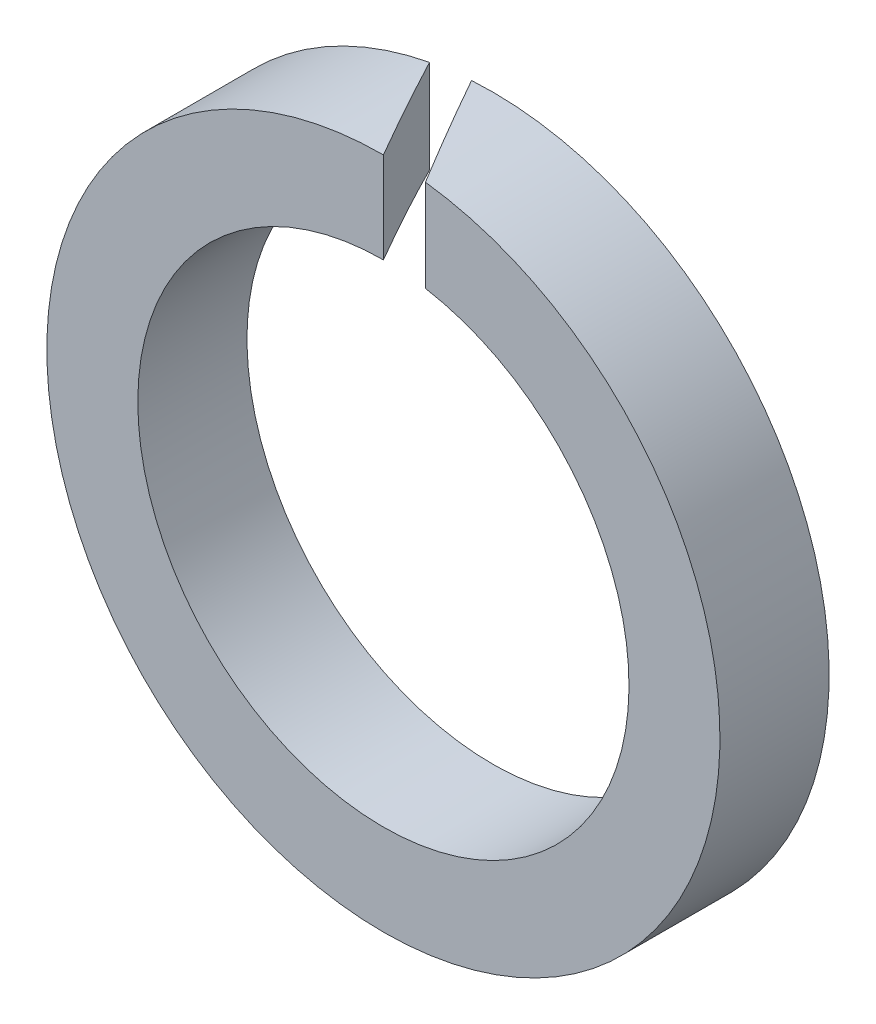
ISO-10303-21;
HEADER;
FILE_DESCRIPTION(('STEP AP214'),'2;1');
FILE_NAME('part.step','',(''),(''),'','','');
FILE_SCHEMA(('AUTOMOTIVE_DESIGN { 1 0 10303 214 1 1 1 1 }'));
ENDSEC;
DATA;
#1=APPLICATION_CONTEXT('core data for automotive mechanical design processes');
#2=APPLICATION_PROTOCOL_DEFINITION('international standard','automotive_design',2000,#1);
#3=PRODUCT_CONTEXT('',#1,'mechanical');
#4=PRODUCT('Part','Part','',(#3));
#5=PRODUCT_RELATED_PRODUCT_CATEGORY('part','',(#4));
#6=PRODUCT_DEFINITION_FORMATION('','',#4);
#7=PRODUCT_DEFINITION_CONTEXT('part definition',#1,'design');
#8=PRODUCT_DEFINITION('design','',#6,#7);
#9=PRODUCT_DEFINITION_SHAPE('','',#8);
#10=(LENGTH_UNIT() NAMED_UNIT(*) SI_UNIT(.MILLI.,.METRE.));
#11=(NAMED_UNIT(*) PLANE_ANGLE_UNIT() SI_UNIT($,.RADIAN.));
#12=(NAMED_UNIT(*) SI_UNIT($,.STERADIAN.) SOLID_ANGLE_UNIT());
#13=UNCERTAINTY_MEASURE_WITH_UNIT(LENGTH_MEASURE(1.E-05),#10,'distance_accuracy_value','');
#14=(GEOMETRIC_REPRESENTATION_CONTEXT(3) GLOBAL_UNCERTAINTY_ASSIGNED_CONTEXT((#13)) GLOBAL_UNIT_ASSIGNED_CONTEXT((#10,
#11,#12)) REPRESENTATION_CONTEXT('',''));
#15=CARTESIAN_POINT('',(0.,0.,0.));
#16=DIRECTION('',(0.,0.,1.));
#17=DIRECTION('',(1.,0.,0.));
#18=AXIS2_PLACEMENT_3D('',#15,#16,#17);
#19=CARTESIAN_POINT('',(0.,0.,-6.));
#20=DIRECTION('',(0.,0.,1.));
#21=DIRECTION('',(1.,0.,0.));
#22=AXIS2_PLACEMENT_3D('',#19,#20,#21);
#23=CYLINDRICAL_SURFACE('',#22,18.5);
#24=CARTESIAN_POINT('',(0.,0.,-3.99999999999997));
#25=DIRECTION('',(0.866025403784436,0.,-0.500000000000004));
#26=DIRECTION('',(0.500000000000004,0.,0.866025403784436));
#27=AXIS2_PLACEMENT_3D('',#24,#25,#26);
#28=ELLIPSE('',#27,36.9999999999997,18.5);
#29=CARTESIAN_POINT('',(2.30940107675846,18.3552898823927,0.));
#30=VERTEX_POINT('',#29);
#31=CARTESIAN_POINT('',(-1.15470053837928,18.4639287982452,-6.00000000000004));
#32=VERTEX_POINT('',#31);
#33=EDGE_CURVE('E80',#30,#32,#28,.F.);
#34=ORIENTED_EDGE('',*,*,#33,.F.);
#35=CARTESIAN_POINT('',(0.,0.,0.));
#36=DIRECTION('',(0.,0.,1.));
#37=DIRECTION('',(1.,0.,0.));
#38=AXIS2_PLACEMENT_3D('',#35,#36,#37);
#39=CIRCLE('',#38,18.5);
#40=CARTESIAN_POINT('',(0.,18.5,0.));
#41=VERTEX_POINT('',#40);
#42=EDGE_CURVE('E87',#41,#30,#39,.T.);
#43=ORIENTED_EDGE('',*,*,#42,.F.);
#44=CARTESIAN_POINT('',(0.,0.,0.));
#45=DIRECTION('',(-0.866025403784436,0.,0.500000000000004));
#46=DIRECTION('',(0.500000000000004,0.,0.866025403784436));
#47=AXIS2_PLACEMENT_3D('',#44,#45,#46);
#48=ELLIPSE('',#47,36.9999999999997,18.5);
#49=CARTESIAN_POINT('',(-3.46410161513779,18.1727818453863,-6.00000000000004));
#50=VERTEX_POINT('',#49);
#51=EDGE_CURVE('E71',#50,#41,#48,.F.);
#52=ORIENTED_EDGE('',*,*,#51,.F.);
#53=CARTESIAN_POINT('',(0.,0.,-6.));
#54=DIRECTION('',(0.,0.,1.));
#55=DIRECTION('',(1.,0.,0.));
#56=AXIS2_PLACEMENT_3D('',#53,#54,#55);
#57=CIRCLE('',#56,18.5);
#58=EDGE_CURVE('E91',#50,#32,#57,.T.);
#59=ORIENTED_EDGE('',*,*,#58,.T.);
#60=EDGE_LOOP('',(#34,#43,#52,#59));
#61=FACE_BOUND('',#60,.T.);
#62=ADVANCED_FACE('F34',(#61),#23,.T.);
#63=CARTESIAN_POINT('',(0.,0.,-6.));
#64=DIRECTION('',(0.,0.,1.));
#65=DIRECTION('',(1.,0.,0.));
#66=AXIS2_PLACEMENT_3D('',#63,#64,#65);
#67=PLANE('',#66);
#68=ORIENTED_EDGE('',*,*,#58,.F.);
#69=DIRECTION('',(0.,1.,0.));
#70=VECTOR('',#69,1.);
#71=CARTESIAN_POINT('',(-3.4641016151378,8.49999999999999,-6.00000000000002));
#72=LINE('',#71,#70);
#73=CARTESIAN_POINT('',(-3.46410161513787,13.0479883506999,-6.00000000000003));
#74=VERTEX_POINT('',#73);
#75=EDGE_CURVE('E74',#74,#50,#72,.T.);
#76=ORIENTED_EDGE('',*,*,#75,.F.);
#77=CARTESIAN_POINT('',(0.,0.,-6.));
#78=DIRECTION('',(0.,0.,1.));
#79=DIRECTION('',(1.,0.,0.));
#80=AXIS2_PLACEMENT_3D('',#77,#78,#79);
#81=CIRCLE('',#80,13.5);
#82=CARTESIAN_POINT('',(-1.15470053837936,13.4505266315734,-6.00000000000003));
#83=VERTEX_POINT('',#82);
#84=EDGE_CURVE('E92',#74,#83,#81,.T.);
#85=ORIENTED_EDGE('',*,*,#84,.T.);
#86=DIRECTION('',(0.,1.,0.));
#87=VECTOR('',#86,1.);
#88=CARTESIAN_POINT('',(-1.15470053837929,8.5,-6.00000000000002));
#89=LINE('',#88,#87);
#90=EDGE_CURVE('E55',#83,#32,#89,.T.);
#91=ORIENTED_EDGE('',*,*,#90,.T.);
#92=EDGE_LOOP('',(#68,#76,#85,#91));
#93=FACE_BOUND('',#92,.T.);
#94=ADVANCED_FACE('F102',(#93),#67,.F.);
#95=CARTESIAN_POINT('',(0.,0.,0.));
#96=DIRECTION('',(0.,0.,1.));
#97=DIRECTION('',(1.,0.,0.));
#98=AXIS2_PLACEMENT_3D('',#95,#96,#97);
#99=PLANE('',#98);
#100=DIRECTION('',(0.,1.,0.));
#101=VECTOR('',#100,1.);
#102=CARTESIAN_POINT('',(0.,8.49999999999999,0.));
#103=LINE('',#102,#101);
#104=CARTESIAN_POINT('',(0.,13.5,0.));
#105=VERTEX_POINT('',#104);
#106=EDGE_CURVE('E48',#105,#41,#103,.T.);
#107=ORIENTED_EDGE('',*,*,#106,.T.);
#108=ORIENTED_EDGE('',*,*,#42,.T.);
#109=DIRECTION('',(0.,1.,0.));
#110=VECTOR('',#109,1.);
#111=CARTESIAN_POINT('',(2.3094010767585,8.5,0.));
#112=LINE('',#111,#110);
#113=CARTESIAN_POINT('',(2.3094010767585,13.3010024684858,0.));
#114=VERTEX_POINT('',#113);
#115=EDGE_CURVE('E104',#114,#30,#112,.T.);
#116=ORIENTED_EDGE('',*,*,#115,.F.);
#117=CARTESIAN_POINT('',(0.,0.,0.));
#118=DIRECTION('',(0.,0.,1.));
#119=DIRECTION('',(1.,0.,0.));
#120=AXIS2_PLACEMENT_3D('',#117,#118,#119);
#121=CIRCLE('',#120,13.5);
#122=EDGE_CURVE('E79',#105,#114,#121,.T.);
#123=ORIENTED_EDGE('',*,*,#122,.F.);
#124=EDGE_LOOP('',(#107,#108,#116,#123));
#125=FACE_BOUND('',#124,.T.);
#126=ADVANCED_FACE('F85',(#125),#99,.T.);
#127=CARTESIAN_POINT('',(0.,0.,-6.));
#128=DIRECTION('',(0.,0.,1.));
#129=DIRECTION('',(1.,0.,0.));
#130=AXIS2_PLACEMENT_3D('',#127,#128,#129);
#131=CYLINDRICAL_SURFACE('',#130,13.5);
#132=ORIENTED_EDGE('',*,*,#84,.F.);
#133=CARTESIAN_POINT('',(0.,0.,0.));
#134=DIRECTION('',(-0.866025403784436,0.,0.500000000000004));
#135=DIRECTION('',(0.500000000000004,0.,0.866025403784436));
#136=AXIS2_PLACEMENT_3D('',#133,#134,#135);
#137=ELLIPSE('',#136,26.9999999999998,13.5);
#138=EDGE_CURVE('E13',#74,#105,#137,.F.);
#139=ORIENTED_EDGE('',*,*,#138,.T.);
#140=ORIENTED_EDGE('',*,*,#122,.T.);
#141=CARTESIAN_POINT('',(0.,0.,-3.99999999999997));
#142=DIRECTION('',(0.866025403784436,0.,-0.500000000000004));
#143=DIRECTION('',(0.500000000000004,0.,0.866025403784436));
#144=AXIS2_PLACEMENT_3D('',#141,#142,#143);
#145=ELLIPSE('',#144,26.9999999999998,13.5);
#146=EDGE_CURVE('E41',#114,#83,#145,.F.);
#147=ORIENTED_EDGE('',*,*,#146,.T.);
#148=EDGE_LOOP('',(#132,#139,#140,#147));
#149=FACE_BOUND('',#148,.T.);
#150=ADVANCED_FACE('F100',(#149),#131,.F.);
#151=CARTESIAN_POINT('',(2.3094010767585,8.5,0.));
#152=DIRECTION('',(0.866025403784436,0.,-0.500000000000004));
#153=DIRECTION('',(-0.500000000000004,0.,-0.866025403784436));
#154=AXIS2_PLACEMENT_3D('',#151,#152,#153);
#155=PLANE('',#154);
#156=ORIENTED_EDGE('',*,*,#33,.T.);
#157=ORIENTED_EDGE('',*,*,#90,.F.);
#158=ORIENTED_EDGE('',*,*,#146,.F.);
#159=ORIENTED_EDGE('',*,*,#115,.T.);
#160=EDGE_LOOP('',(#156,#157,#158,#159));
#161=FACE_BOUND('',#160,.T.);
#162=ADVANCED_FACE('F108',(#161),#155,.F.);
#163=CARTESIAN_POINT('',(0.,8.49999999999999,0.));
#164=DIRECTION('',(-0.866025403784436,0.,0.500000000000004));
#165=DIRECTION('',(0.500000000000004,0.,0.866025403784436));
#166=AXIS2_PLACEMENT_3D('',#163,#164,#165);
#167=PLANE('',#166);
#168=ORIENTED_EDGE('',*,*,#51,.T.);
#169=ORIENTED_EDGE('',*,*,#106,.F.);
#170=ORIENTED_EDGE('',*,*,#138,.F.);
#171=ORIENTED_EDGE('',*,*,#75,.T.);
#172=EDGE_LOOP('',(#168,#169,#170,#171));
#173=FACE_BOUND('',#172,.T.);
#174=ADVANCED_FACE('F72',(#173),#167,.F.);
#175=CLOSED_SHELL('',(#62,#94,#126,#150,#162,#174));
#176=MANIFOLD_SOLID_BREP('B2',#175);
#177=ADVANCED_BREP_SHAPE_REPRESENTATION('',(#18,#176),#14);
#178=SHAPE_DEFINITION_REPRESENTATION(#9,#177);
ENDSEC;
END-ISO-10303-21;
